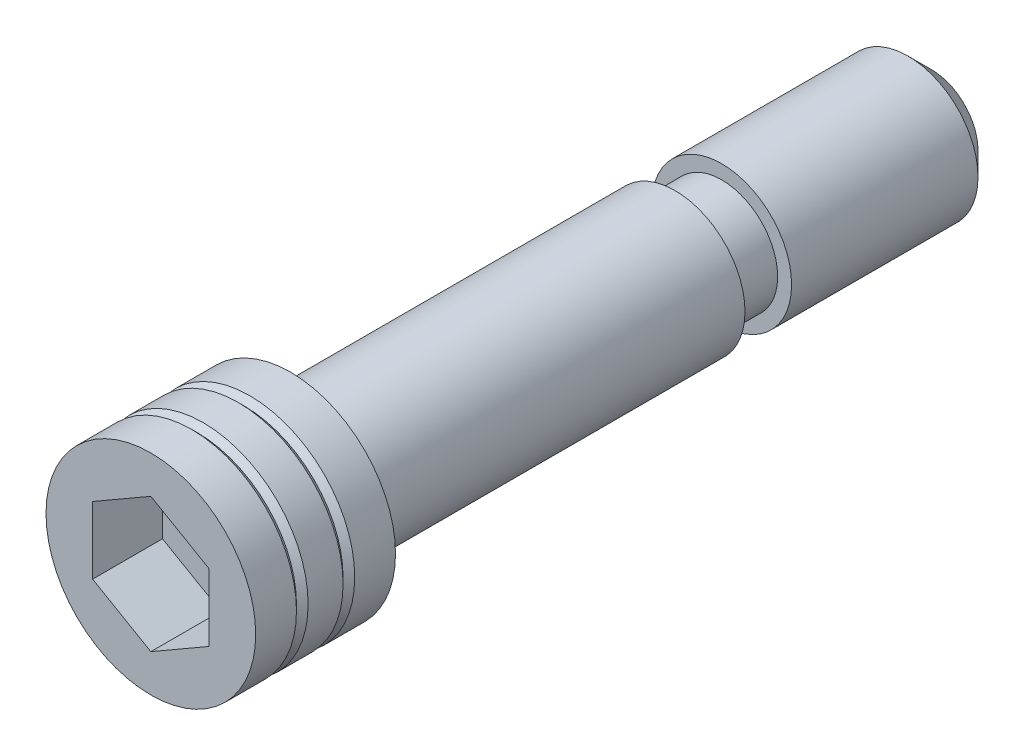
ISO-10303-21;
HEADER;
FILE_DESCRIPTION(('STEP AP214'),'2;1');
FILE_NAME('part.step','',(''),(''),'','','');
FILE_SCHEMA(('AUTOMOTIVE_DESIGN { 1 0 10303 214 1 1 1 1 }'));
ENDSEC;
DATA;
#1=APPLICATION_CONTEXT('core data for automotive mechanical design processes');
#2=APPLICATION_PROTOCOL_DEFINITION('international standard','automotive_design',2000,#1);
#3=PRODUCT_CONTEXT('',#1,'mechanical');
#4=PRODUCT('Part','Part','',(#3));
#5=PRODUCT_RELATED_PRODUCT_CATEGORY('part','',(#4));
#6=PRODUCT_DEFINITION_FORMATION('','',#4);
#7=PRODUCT_DEFINITION_CONTEXT('part definition',#1,'design');
#8=PRODUCT_DEFINITION('design','',#6,#7);
#9=PRODUCT_DEFINITION_SHAPE('','',#8);
#10=(LENGTH_UNIT() NAMED_UNIT(*) SI_UNIT(.MILLI.,.METRE.));
#11=(NAMED_UNIT(*) PLANE_ANGLE_UNIT() SI_UNIT($,.RADIAN.));
#12=(NAMED_UNIT(*) SI_UNIT($,.STERADIAN.) SOLID_ANGLE_UNIT());
#13=UNCERTAINTY_MEASURE_WITH_UNIT(LENGTH_MEASURE(1.E-05),#10,'distance_accuracy_value','');
#14=(GEOMETRIC_REPRESENTATION_CONTEXT(3) GLOBAL_UNCERTAINTY_ASSIGNED_CONTEXT((#13)) GLOBAL_UNIT_ASSIGNED_CONTEXT((#10,
#11,#12)) REPRESENTATION_CONTEXT('',''));
#15=CARTESIAN_POINT('',(0.,0.,0.));
#16=DIRECTION('',(0.,0.,1.));
#17=DIRECTION('',(1.,0.,0.));
#18=AXIS2_PLACEMENT_3D('',#15,#16,#17);
#19=CARTESIAN_POINT('',(0.,0.,25.));
#20=DIRECTION('',(0.,0.,1.));
#21=DIRECTION('',(1.,0.,0.));
#22=AXIS2_PLACEMENT_3D('',#19,#20,#21);
#23=CYLINDRICAL_SURFACE('',#22,9.);
#24=CARTESIAN_POINT('',(0.,0.,0.));
#25=DIRECTION('',(0.,0.,1.));
#26=DIRECTION('',(1.,0.,0.));
#27=AXIS2_PLACEMENT_3D('',#24,#25,#26);
#28=CIRCLE('',#27,9.);
#29=CARTESIAN_POINT('',(9.,0.,0.));
#30=VERTEX_POINT('',#29);
#31=EDGE_CURVE('E128',#30,#30,#28,.T.);
#32=ORIENTED_EDGE('',*,*,#31,.T.);
#33=EDGE_LOOP('',(#32));
#34=FACE_BOUND('',#33,.T.);
#35=CARTESIAN_POINT('',(0.,0.,3.5));
#36=DIRECTION('',(0.,0.,-1.));
#37=DIRECTION('',(-1.,0.,0.));
#38=AXIS2_PLACEMENT_3D('',#35,#36,#37);
#39=CIRCLE('',#38,9.);
#40=CARTESIAN_POINT('',(-9.,0.,3.5));
#41=VERTEX_POINT('',#40);
#42=EDGE_CURVE('E18',#41,#41,#39,.F.);
#43=ORIENTED_EDGE('',*,*,#42,.F.);
#44=EDGE_LOOP('',(#43));
#45=FACE_BOUND('',#44,.T.);
#46=ADVANCED_FACE('F14',(#34,#45),#23,.T.);
#47=CARTESIAN_POINT('',(0.,0.,-55.));
#48=DIRECTION('',(0.,0.,1.));
#49=DIRECTION('',(1.,0.,0.));
#50=AXIS2_PLACEMENT_3D('',#47,#48,#49);
#51=PLANE('',#50);
#52=CARTESIAN_POINT('',(0.,0.,-55.));
#53=DIRECTION('',(0.,0.,1.));
#54=DIRECTION('',(1.,0.,0.));
#55=AXIS2_PLACEMENT_3D('',#52,#53,#54);
#56=CIRCLE('',#55,4.);
#57=CARTESIAN_POINT('',(4.,0.,-55.));
#58=VERTEX_POINT('',#57);
#59=EDGE_CURVE('E9',#58,#58,#56,.T.);
#60=ORIENTED_EDGE('',*,*,#59,.F.);
#61=EDGE_LOOP('',(#60));
#62=FACE_BOUND('',#61,.T.);
#63=ADVANCED_FACE('F16',(#62),#51,.F.);
#64=CARTESIAN_POINT('',(0.,0.,-55.));
#65=DIRECTION('',(0.,0.,1.));
#66=DIRECTION('',(1.,0.,0.));
#67=AXIS2_PLACEMENT_3D('',#64,#65,#66);
#68=CONICAL_SURFACE('',#67,4.,0.785398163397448);
#69=CARTESIAN_POINT('',(0.,0.,-53.));
#70=DIRECTION('',(0.,0.,1.));
#71=DIRECTION('',(1.,0.,0.));
#72=AXIS2_PLACEMENT_3D('',#69,#70,#71);
#73=CIRCLE('',#72,6.);
#74=CARTESIAN_POINT('',(6.,0.,-53.));
#75=VERTEX_POINT('',#74);
#76=EDGE_CURVE('E23',#75,#75,#73,.T.);
#77=ORIENTED_EDGE('',*,*,#76,.F.);
#78=EDGE_LOOP('',(#77));
#79=FACE_BOUND('',#78,.T.);
#80=ORIENTED_EDGE('',*,*,#59,.T.);
#81=EDGE_LOOP('',(#80));
#82=FACE_BOUND('',#81,.T.);
#83=ADVANCED_FACE('F281',(#79,#82),#68,.T.);
#84=CARTESIAN_POINT('',(0.,0.,25.));
#85=DIRECTION('',(0.,0.,1.));
#86=DIRECTION('',(1.,0.,0.));
#87=AXIS2_PLACEMENT_3D('',#84,#85,#86);
#88=CYLINDRICAL_SURFACE('',#87,6.);
#89=CARTESIAN_POINT('',(0.,0.,-37.));
#90=DIRECTION('',(0.,0.,1.));
#91=DIRECTION('',(1.,0.,0.));
#92=AXIS2_PLACEMENT_3D('',#89,#90,#91);
#93=CIRCLE('',#92,6.);
#94=CARTESIAN_POINT('',(6.,0.,-37.));
#95=VERTEX_POINT('',#94);
#96=EDGE_CURVE('E143',#95,#95,#93,.T.);
#97=ORIENTED_EDGE('',*,*,#96,.F.);
#98=EDGE_LOOP('',(#97));
#99=FACE_BOUND('',#98,.T.);
#100=ORIENTED_EDGE('',*,*,#76,.T.);
#101=EDGE_LOOP('',(#100));
#102=FACE_BOUND('',#101,.T.);
#103=ADVANCED_FACE('F290',(#99,#102),#88,.T.);
#104=CARTESIAN_POINT('',(-6.,0.,-37.));
#105=DIRECTION('',(0.,0.,-1.));
#106=DIRECTION('',(-1.,0.,0.));
#107=AXIS2_PLACEMENT_3D('',#104,#105,#106);
#108=PLANE('',#107);
#109=CARTESIAN_POINT('',(0.,0.,-37.));
#110=DIRECTION('',(0.,0.,1.));
#111=DIRECTION('',(1.,0.,0.));
#112=AXIS2_PLACEMENT_3D('',#109,#110,#111);
#113=CIRCLE('',#112,4.8);
#114=CARTESIAN_POINT('',(4.8,0.,-37.));
#115=VERTEX_POINT('',#114);
#116=EDGE_CURVE('E140',#115,#115,#113,.T.);
#117=ORIENTED_EDGE('',*,*,#116,.F.);
#118=EDGE_LOOP('',(#117));
#119=FACE_BOUND('',#118,.T.);
#120=ORIENTED_EDGE('',*,*,#96,.T.);
#121=EDGE_LOOP('',(#120));
#122=FACE_BOUND('',#121,.T.);
#123=ADVANCED_FACE('F299',(#119,#122),#108,.F.);
#124=CARTESIAN_POINT('',(0.,0.,25.));
#125=DIRECTION('',(0.,0.,1.));
#126=DIRECTION('',(1.,0.,0.));
#127=AXIS2_PLACEMENT_3D('',#124,#125,#126);
#128=CYLINDRICAL_SURFACE('',#127,4.8);
#129=CARTESIAN_POINT('',(0.,0.,-33.));
#130=DIRECTION('',(0.,0.,1.));
#131=DIRECTION('',(1.,0.,0.));
#132=AXIS2_PLACEMENT_3D('',#129,#130,#131);
#133=CIRCLE('',#132,4.8);
#134=CARTESIAN_POINT('',(4.8,0.,-33.));
#135=VERTEX_POINT('',#134);
#136=EDGE_CURVE('E137',#135,#135,#133,.T.);
#137=ORIENTED_EDGE('',*,*,#136,.F.);
#138=EDGE_LOOP('',(#137));
#139=FACE_BOUND('',#138,.T.);
#140=ORIENTED_EDGE('',*,*,#116,.T.);
#141=EDGE_LOOP('',(#140));
#142=FACE_BOUND('',#141,.T.);
#143=ADVANCED_FACE('F309',(#139,#142),#128,.T.);
#144=CARTESIAN_POINT('',(-4.8,0.,-33.));
#145=DIRECTION('',(0.,0.,1.));
#146=DIRECTION('',(1.,0.,0.));
#147=AXIS2_PLACEMENT_3D('',#144,#145,#146);
#148=PLANE('',#147);
#149=CARTESIAN_POINT('',(0.,0.,-33.));
#150=DIRECTION('',(0.,0.,1.));
#151=DIRECTION('',(1.,0.,0.));
#152=AXIS2_PLACEMENT_3D('',#149,#150,#151);
#153=CIRCLE('',#152,6.);
#154=CARTESIAN_POINT('',(6.,0.,-33.));
#155=VERTEX_POINT('',#154);
#156=EDGE_CURVE('E134',#155,#155,#153,.T.);
#157=ORIENTED_EDGE('',*,*,#156,.F.);
#158=EDGE_LOOP('',(#157));
#159=FACE_BOUND('',#158,.T.);
#160=ORIENTED_EDGE('',*,*,#136,.T.);
#161=EDGE_LOOP('',(#160));
#162=FACE_BOUND('',#161,.T.);
#163=ADVANCED_FACE('F319',(#159,#162),#148,.F.);
#164=CARTESIAN_POINT('',(0.,0.,25.));
#165=DIRECTION('',(0.,0.,1.));
#166=DIRECTION('',(1.,0.,0.));
#167=AXIS2_PLACEMENT_3D('',#164,#165,#166);
#168=CYLINDRICAL_SURFACE('',#167,6.);
#169=CARTESIAN_POINT('',(0.,0.,0.));
#170=DIRECTION('',(0.,0.,1.));
#171=DIRECTION('',(1.,0.,0.));
#172=AXIS2_PLACEMENT_3D('',#169,#170,#171);
#173=CIRCLE('',#172,6.);
#174=CARTESIAN_POINT('',(6.,0.,0.));
#175=VERTEX_POINT('',#174);
#176=EDGE_CURVE('E131',#175,#175,#173,.T.);
#177=ORIENTED_EDGE('',*,*,#176,.F.);
#178=EDGE_LOOP('',(#177));
#179=FACE_BOUND('',#178,.T.);
#180=ORIENTED_EDGE('',*,*,#156,.T.);
#181=EDGE_LOOP('',(#180));
#182=FACE_BOUND('',#181,.T.);
#183=ADVANCED_FACE('F329',(#179,#182),#168,.T.);
#184=CARTESIAN_POINT('',(-6.,0.,0.));
#185=DIRECTION('',(0.,0.,1.));
#186=DIRECTION('',(1.,0.,0.));
#187=AXIS2_PLACEMENT_3D('',#184,#185,#186);
#188=PLANE('',#187);
#189=ORIENTED_EDGE('',*,*,#31,.F.);
#190=EDGE_LOOP('',(#189));
#191=FACE_BOUND('',#190,.T.);
#192=ORIENTED_EDGE('',*,*,#176,.T.);
#193=EDGE_LOOP('',(#192));
#194=FACE_BOUND('',#193,.T.);
#195=ADVANCED_FACE('F339',(#191,#194),#188,.F.);
#196=CARTESIAN_POINT('',(0.,0.,2.6116035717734));
#197=DIRECTION('',(0.,0.,-1.));
#198=DIRECTION('',(-1.,0.,0.));
#199=AXIS2_PLACEMENT_3D('',#196,#197,#198);
#200=CONICAL_SURFACE('',#199,9.8883964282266,0.785398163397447);
#201=CARTESIAN_POINT('',(0.,0.,4.));
#202=DIRECTION('',(0.,0.,-1.));
#203=DIRECTION('',(-1.,0.,0.));
#204=AXIS2_PLACEMENT_3D('',#201,#202,#203);
#205=CIRCLE('',#204,8.5);
#206=CARTESIAN_POINT('',(-8.5,0.,4.));
#207=VERTEX_POINT('',#206);
#208=EDGE_CURVE('E156',#207,#207,#205,.T.);
#209=ORIENTED_EDGE('',*,*,#208,.T.);
#210=EDGE_LOOP('',(#209));
#211=FACE_BOUND('',#210,.T.);
#212=ORIENTED_EDGE('',*,*,#42,.T.);
#213=EDGE_LOOP('',(#212));
#214=FACE_BOUND('',#213,.T.);
#215=ADVANCED_FACE('F349',(#211,#214),#200,.T.);
#216=CARTESIAN_POINT('',(0.,0.,4.));
#217=DIRECTION('',(0.,0.,1.));
#218=DIRECTION('',(1.,0.,0.));
#219=AXIS2_PLACEMENT_3D('',#216,#217,#218);
#220=CONICAL_SURFACE('',#219,8.5,0.785398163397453);
#221=ORIENTED_EDGE('',*,*,#208,.F.);
#222=EDGE_LOOP('',(#221));
#223=FACE_BOUND('',#222,.T.);
#224=CARTESIAN_POINT('',(0.,0.,4.5));
#225=DIRECTION('',(0.,0.,1.));
#226=DIRECTION('',(1.,0.,0.));
#227=AXIS2_PLACEMENT_3D('',#224,#225,#226);
#228=CIRCLE('',#227,9.);
#229=CARTESIAN_POINT('',(9.,0.,4.5));
#230=VERTEX_POINT('',#229);
#231=EDGE_CURVE('E154',#230,#230,#228,.F.);
#232=ORIENTED_EDGE('',*,*,#231,.T.);
#233=EDGE_LOOP('',(#232));
#234=FACE_BOUND('',#233,.T.);
#235=ADVANCED_FACE('F206',(#223,#234),#220,.T.);
#236=CARTESIAN_POINT('',(5.,2.88675134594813,6.));
#237=DIRECTION('',(0.,0.,-1.));
#238=DIRECTION('',(-1.,0.,0.));
#239=AXIS2_PLACEMENT_3D('',#236,#237,#238);
#240=PLANE('',#239);
#241=DIRECTION('',(-0.866025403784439,0.5,0.));
#242=VECTOR('',#241,1.);
#243=CARTESIAN_POINT('',(5.,2.88675134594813,6.));
#244=LINE('',#243,#242);
#245=CARTESIAN_POINT('',(5.,2.88675134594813,6.));
#246=VERTEX_POINT('',#245);
#247=CARTESIAN_POINT('',(0.,5.77350269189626,6.));
#248=VERTEX_POINT('',#247);
#249=EDGE_CURVE('E103',#246,#248,#244,.T.);
#250=ORIENTED_EDGE('',*,*,#249,.T.);
#251=DIRECTION('',(-0.866025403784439,-0.5,0.));
#252=VECTOR('',#251,1.);
#253=CARTESIAN_POINT('',(0.,5.77350269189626,6.));
#254=LINE('',#253,#252);
#255=CARTESIAN_POINT('',(-5.,2.88675134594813,6.));
#256=VERTEX_POINT('',#255);
#257=EDGE_CURVE('E106',#248,#256,#254,.T.);
#258=ORIENTED_EDGE('',*,*,#257,.T.);
#259=DIRECTION('',(0.,-1.,0.));
#260=VECTOR('',#259,1.);
#261=CARTESIAN_POINT('',(-5.,2.88675134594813,6.));
#262=LINE('',#261,#260);
#263=CARTESIAN_POINT('',(-5.,-2.88675134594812,6.));
#264=VERTEX_POINT('',#263);
#265=EDGE_CURVE('E77',#256,#264,#262,.T.);
#266=ORIENTED_EDGE('',*,*,#265,.T.);
#267=DIRECTION('',(0.866025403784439,-0.5,0.));
#268=VECTOR('',#267,1.);
#269=CARTESIAN_POINT('',(-5.,-2.88675134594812,6.));
#270=LINE('',#269,#268);
#271=CARTESIAN_POINT('',(0.,-5.77350269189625,6.));
#272=VERTEX_POINT('',#271);
#273=EDGE_CURVE('E109',#264,#272,#270,.T.);
#274=ORIENTED_EDGE('',*,*,#273,.T.);
#275=DIRECTION('',(0.866025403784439,0.5,0.));
#276=VECTOR('',#275,1.);
#277=CARTESIAN_POINT('',(0.,-5.77350269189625,6.));
#278=LINE('',#277,#276);
#279=CARTESIAN_POINT('',(5.,-2.88675134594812,6.));
#280=VERTEX_POINT('',#279);
#281=EDGE_CURVE('E112',#272,#280,#278,.T.);
#282=ORIENTED_EDGE('',*,*,#281,.T.);
#283=DIRECTION('',(0.,1.,0.));
#284=VECTOR('',#283,1.);
#285=CARTESIAN_POINT('',(5.,-2.88675134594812,6.));
#286=LINE('',#285,#284);
#287=EDGE_CURVE('E115',#280,#246,#286,.T.);
#288=ORIENTED_EDGE('',*,*,#287,.T.);
#289=EDGE_LOOP('',(#250,#258,#266,#274,#282,#288));
#290=FACE_BOUND('',#289,.T.);
#291=ADVANCED_FACE('F203',(#290),#240,.F.);
#292=CARTESIAN_POINT('',(-5.,2.88675134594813,6.));
#293=DIRECTION('',(-1.,0.,0.));
#294=DIRECTION('',(0.,0.,1.));
#295=AXIS2_PLACEMENT_3D('',#292,#293,#294);
#296=PLANE('',#295);
#297=DIRECTION('',(0.,-1.,0.));
#298=VECTOR('',#297,1.);
#299=CARTESIAN_POINT('',(-5.,2.88675134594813,12.));
#300=LINE('',#299,#298);
#301=CARTESIAN_POINT('',(-5.,2.88675134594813,12.));
#302=VERTEX_POINT('',#301);
#303=CARTESIAN_POINT('',(-5.,-2.88675134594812,12.));
#304=VERTEX_POINT('',#303);
#305=EDGE_CURVE('E74',#302,#304,#300,.T.);
#306=ORIENTED_EDGE('',*,*,#305,.T.);
#307=DIRECTION('',(0.,0.,1.));
#308=VECTOR('',#307,1.);
#309=CARTESIAN_POINT('',(-5.,-2.88675134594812,6.));
#310=LINE('',#309,#308);
#311=EDGE_CURVE('E81',#264,#304,#310,.T.);
#312=ORIENTED_EDGE('',*,*,#311,.F.);
#313=ORIENTED_EDGE('',*,*,#265,.F.);
#314=DIRECTION('',(0.,0.,1.));
#315=VECTOR('',#314,1.);
#316=CARTESIAN_POINT('',(-5.,2.88675134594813,6.));
#317=LINE('',#316,#315);
#318=EDGE_CURVE('E70',#256,#302,#317,.T.);
#319=ORIENTED_EDGE('',*,*,#318,.T.);
#320=EDGE_LOOP('',(#306,#312,#313,#319));
#321=FACE_BOUND('',#320,.T.);
#322=ADVANCED_FACE('F72',(#321),#296,.F.);
#323=CARTESIAN_POINT('',(-5.,-2.88675134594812,6.));
#324=DIRECTION('',(-0.5,-0.866025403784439,0.));
#325=DIRECTION('',(0.866025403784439,-0.5,0.));
#326=AXIS2_PLACEMENT_3D('',#323,#324,#325);
#327=PLANE('',#326);
#328=DIRECTION('',(0.866025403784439,-0.5,0.));
#329=VECTOR('',#328,1.);
#330=CARTESIAN_POINT('',(-5.,-2.88675134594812,12.));
#331=LINE('',#330,#329);
#332=CARTESIAN_POINT('',(0.,-5.77350269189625,12.));
#333=VERTEX_POINT('',#332);
#334=EDGE_CURVE('E93',#304,#333,#331,.T.);
#335=ORIENTED_EDGE('',*,*,#334,.T.);
#336=DIRECTION('',(0.,0.,1.));
#337=VECTOR('',#336,1.);
#338=CARTESIAN_POINT('',(0.,-5.77350269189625,6.));
#339=LINE('',#338,#337);
#340=EDGE_CURVE('E122',#272,#333,#339,.T.);
#341=ORIENTED_EDGE('',*,*,#340,.F.);
#342=ORIENTED_EDGE('',*,*,#273,.F.);
#343=ORIENTED_EDGE('',*,*,#311,.T.);
#344=EDGE_LOOP('',(#335,#341,#342,#343));
#345=FACE_BOUND('',#344,.T.);
#346=ADVANCED_FACE('F215',(#345),#327,.F.);
#347=CARTESIAN_POINT('',(0.,-5.77350269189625,6.));
#348=DIRECTION('',(0.5,-0.866025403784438,0.));
#349=DIRECTION('',(0.866025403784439,0.5,0.));
#350=AXIS2_PLACEMENT_3D('',#347,#348,#349);
#351=PLANE('',#350);
#352=DIRECTION('',(0.866025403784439,0.5,0.));
#353=VECTOR('',#352,1.);
#354=CARTESIAN_POINT('',(0.,-5.77350269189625,12.));
#355=LINE('',#354,#353);
#356=CARTESIAN_POINT('',(5.,-2.88675134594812,12.));
#357=VERTEX_POINT('',#356);
#358=EDGE_CURVE('E95',#333,#357,#355,.T.);
#359=ORIENTED_EDGE('',*,*,#358,.T.);
#360=DIRECTION('',(0.,0.,1.));
#361=VECTOR('',#360,1.);
#362=CARTESIAN_POINT('',(5.,-2.88675134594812,6.));
#363=LINE('',#362,#361);
#364=EDGE_CURVE('E120',#280,#357,#363,.T.);
#365=ORIENTED_EDGE('',*,*,#364,.F.);
#366=ORIENTED_EDGE('',*,*,#281,.F.);
#367=ORIENTED_EDGE('',*,*,#340,.T.);
#368=EDGE_LOOP('',(#359,#365,#366,#367));
#369=FACE_BOUND('',#368,.T.);
#370=ADVANCED_FACE('F212',(#369),#351,.F.);
#371=CARTESIAN_POINT('',(5.,-2.88675134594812,6.));
#372=DIRECTION('',(1.,0.,0.));
#373=DIRECTION('',(0.,0.,-1.));
#374=AXIS2_PLACEMENT_3D('',#371,#372,#373);
#375=PLANE('',#374);
#376=DIRECTION('',(0.,1.,0.));
#377=VECTOR('',#376,1.);
#378=CARTESIAN_POINT('',(5.,-2.88675134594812,12.));
#379=LINE('',#378,#377);
#380=CARTESIAN_POINT('',(5.,2.88675134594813,12.));
#381=VERTEX_POINT('',#380);
#382=EDGE_CURVE('E101',#357,#381,#379,.T.);
#383=ORIENTED_EDGE('',*,*,#382,.T.);
#384=DIRECTION('',(0.,0.,1.));
#385=VECTOR('',#384,1.);
#386=CARTESIAN_POINT('',(5.,2.88675134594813,6.));
#387=LINE('',#386,#385);
#388=EDGE_CURVE('E38',#246,#381,#387,.T.);
#389=ORIENTED_EDGE('',*,*,#388,.F.);
#390=ORIENTED_EDGE('',*,*,#287,.F.);
#391=ORIENTED_EDGE('',*,*,#364,.T.);
#392=EDGE_LOOP('',(#383,#389,#390,#391));
#393=FACE_BOUND('',#392,.T.);
#394=ADVANCED_FACE('F208',(#393),#375,.F.);
#395=CARTESIAN_POINT('',(5.,2.88675134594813,6.));
#396=DIRECTION('',(0.5,0.866025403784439,0.));
#397=DIRECTION('',(-0.866025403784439,0.5,0.));
#398=AXIS2_PLACEMENT_3D('',#395,#396,#397);
#399=PLANE('',#398);
#400=DIRECTION('',(-0.866025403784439,0.5,0.));
#401=VECTOR('',#400,1.);
#402=CARTESIAN_POINT('',(5.,2.88675134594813,12.));
#403=LINE('',#402,#401);
#404=CARTESIAN_POINT('',(0.,5.77350269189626,12.));
#405=VERTEX_POINT('',#404);
#406=EDGE_CURVE('E31',#381,#405,#403,.T.);
#407=ORIENTED_EDGE('',*,*,#406,.T.);
#408=DIRECTION('',(0.,0.,1.));
#409=VECTOR('',#408,1.);
#410=CARTESIAN_POINT('',(0.,5.77350269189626,6.));
#411=LINE('',#410,#409);
#412=EDGE_CURVE('E82',#248,#405,#411,.T.);
#413=ORIENTED_EDGE('',*,*,#412,.F.);
#414=ORIENTED_EDGE('',*,*,#249,.F.);
#415=ORIENTED_EDGE('',*,*,#388,.T.);
#416=EDGE_LOOP('',(#407,#413,#414,#415));
#417=FACE_BOUND('',#416,.T.);
#418=ADVANCED_FACE('F211',(#417),#399,.F.);
#419=CARTESIAN_POINT('',(0.,5.77350269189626,6.));
#420=DIRECTION('',(-0.5,0.866025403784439,0.));
#421=DIRECTION('',(-0.866025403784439,-0.5,0.));
#422=AXIS2_PLACEMENT_3D('',#419,#420,#421);
#423=PLANE('',#422);
#424=DIRECTION('',(-0.866025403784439,-0.5,0.));
#425=VECTOR('',#424,1.);
#426=CARTESIAN_POINT('',(0.,5.77350269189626,12.));
#427=LINE('',#426,#425);
#428=EDGE_CURVE('E85',#405,#302,#427,.T.);
#429=ORIENTED_EDGE('',*,*,#428,.T.);
#430=ORIENTED_EDGE('',*,*,#318,.F.);
#431=ORIENTED_EDGE('',*,*,#257,.F.);
#432=ORIENTED_EDGE('',*,*,#412,.T.);
#433=EDGE_LOOP('',(#429,#430,#431,#432));
#434=FACE_BOUND('',#433,.T.);
#435=ADVANCED_FACE('F86',(#434),#423,.F.);
#436=CARTESIAN_POINT('',(-9.,0.,12.));
#437=DIRECTION('',(0.,0.,-1.));
#438=DIRECTION('',(-1.,0.,0.));
#439=AXIS2_PLACEMENT_3D('',#436,#437,#438);
#440=PLANE('',#439);
#441=ORIENTED_EDGE('',*,*,#428,.F.);
#442=ORIENTED_EDGE('',*,*,#406,.F.);
#443=ORIENTED_EDGE('',*,*,#382,.F.);
#444=ORIENTED_EDGE('',*,*,#358,.F.);
#445=ORIENTED_EDGE('',*,*,#334,.F.);
#446=ORIENTED_EDGE('',*,*,#305,.F.);
#447=EDGE_LOOP('',(#441,#442,#443,#444,#445,#446));
#448=FACE_BOUND('',#447,.T.);
#449=CARTESIAN_POINT('',(0.,0.,12.));
#450=DIRECTION('',(0.,0.,1.));
#451=DIRECTION('',(1.,0.,0.));
#452=AXIS2_PLACEMENT_3D('',#449,#450,#451);
#453=CIRCLE('',#452,9.);
#454=CARTESIAN_POINT('',(9.,0.,12.));
#455=VERTEX_POINT('',#454);
#456=EDGE_CURVE('E119',#455,#455,#453,.T.);
#457=ORIENTED_EDGE('',*,*,#456,.T.);
#458=EDGE_LOOP('',(#457));
#459=FACE_BOUND('',#458,.T.);
#460=ADVANCED_FACE('F89',(#448,#459),#440,.F.);
#461=ORIENTED_EDGE('',*,*,#456,.F.);
#462=EDGE_LOOP('',(#461));
#463=FACE_BOUND('',#462,.T.);
#464=CARTESIAN_POINT('',(0.,0.,8.5));
#465=DIRECTION('',(0.,0.,1.));
#466=DIRECTION('',(1.,0.,0.));
#467=AXIS2_PLACEMENT_3D('',#464,#465,#466);
#468=CIRCLE('',#467,9.);
#469=CARTESIAN_POINT('',(9.,0.,8.5));
#470=VERTEX_POINT('',#469);
#471=EDGE_CURVE('E148',#470,#470,#468,.F.);
#472=ORIENTED_EDGE('',*,*,#471,.F.);
#473=EDGE_LOOP('',(#472));
#474=FACE_BOUND('',#473,.T.);
#475=ADVANCED_FACE('F174',(#463,#474),#23,.T.);
#476=CARTESIAN_POINT('',(0.,0.,8.));
#477=DIRECTION('',(0.,0.,1.));
#478=DIRECTION('',(1.,0.,0.));
#479=AXIS2_PLACEMENT_3D('',#476,#477,#478);
#480=CONICAL_SURFACE('',#479,8.5,0.785398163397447);
#481=CARTESIAN_POINT('',(0.,0.,8.));
#482=DIRECTION('',(0.,0.,-1.));
#483=DIRECTION('',(-1.,0.,0.));
#484=AXIS2_PLACEMENT_3D('',#481,#482,#483);
#485=CIRCLE('',#484,8.5);
#486=CARTESIAN_POINT('',(-8.5,0.,8.));
#487=VERTEX_POINT('',#486);
#488=EDGE_CURVE('E152',#487,#487,#485,.T.);
#489=ORIENTED_EDGE('',*,*,#488,.F.);
#490=EDGE_LOOP('',(#489));
#491=FACE_BOUND('',#490,.T.);
#492=ORIENTED_EDGE('',*,*,#471,.T.);
#493=EDGE_LOOP('',(#492));
#494=FACE_BOUND('',#493,.T.);
#495=ADVANCED_FACE('F171',(#491,#494),#480,.T.);
#496=CARTESIAN_POINT('',(0.,0.,6.61160357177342));
#497=DIRECTION('',(0.,0.,-1.));
#498=DIRECTION('',(-1.,0.,0.));
#499=AXIS2_PLACEMENT_3D('',#496,#497,#498);
#500=CONICAL_SURFACE('',#499,9.8883964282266,0.785398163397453);
#501=ORIENTED_EDGE('',*,*,#488,.T.);
#502=EDGE_LOOP('',(#501));
#503=FACE_BOUND('',#502,.T.);
#504=CARTESIAN_POINT('',(0.,0.,7.5));
#505=DIRECTION('',(0.,0.,-1.));
#506=DIRECTION('',(-1.,0.,0.));
#507=AXIS2_PLACEMENT_3D('',#504,#505,#506);
#508=CIRCLE('',#507,9.);
#509=CARTESIAN_POINT('',(-9.,0.,7.5));
#510=VERTEX_POINT('',#509);
#511=EDGE_CURVE('E151',#510,#510,#508,.F.);
#512=ORIENTED_EDGE('',*,*,#511,.T.);
#513=EDGE_LOOP('',(#512));
#514=FACE_BOUND('',#513,.T.);
#515=ADVANCED_FACE('F168',(#503,#514),#500,.T.);
#516=ORIENTED_EDGE('',*,*,#511,.F.);
#517=EDGE_LOOP('',(#516));
#518=FACE_BOUND('',#517,.T.);
#519=ORIENTED_EDGE('',*,*,#231,.F.);
#520=EDGE_LOOP('',(#519));
#521=FACE_BOUND('',#520,.T.);
#522=ADVANCED_FACE('F181',(#518,#521),#23,.T.);
#523=CLOSED_SHELL('',(#46,#63,#83,#103,#123,#143,#163,#183,#195,#215,#235,#291,#322,#346,#370,
#394,#418,#435,#460,#475,#495,#515,#522));
#524=MANIFOLD_SOLID_BREP('B1',#523);
#525=ADVANCED_BREP_SHAPE_REPRESENTATION('',(#18,#524),#14);
#526=SHAPE_DEFINITION_REPRESENTATION(#9,#525);
ENDSEC;
END-ISO-10303-21;
